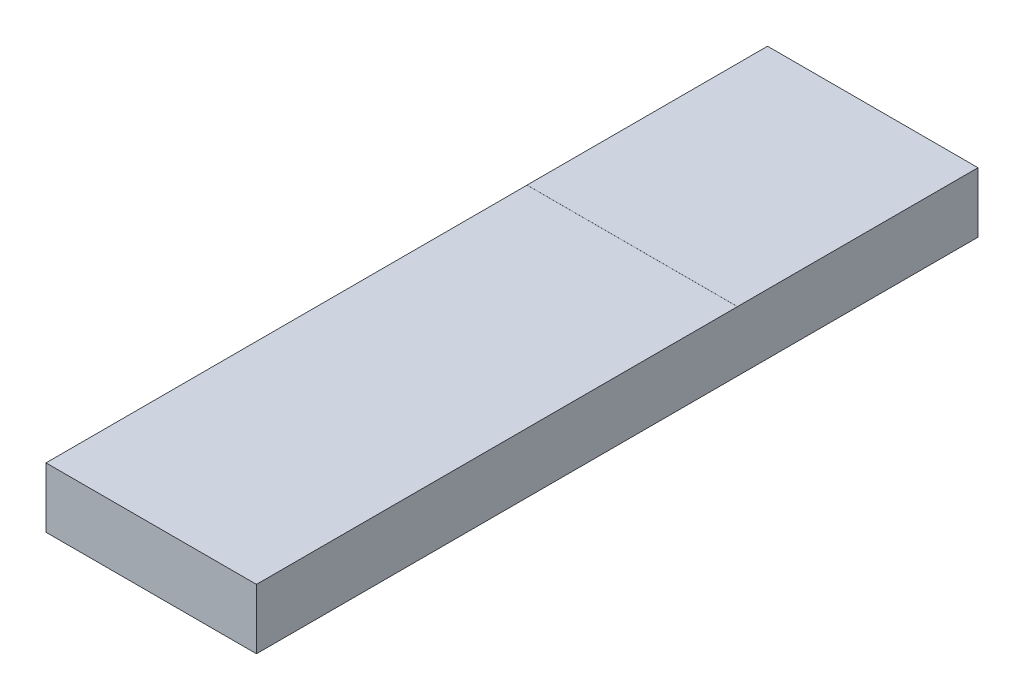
ISO-10303-21;
HEADER;
FILE_DESCRIPTION(('STEP AP214'),'2;1');
FILE_NAME('part.step','',(''),(''),'','','');
FILE_SCHEMA(('AUTOMOTIVE_DESIGN { 1 0 10303 214 1 1 1 1 }'));
ENDSEC;
DATA;
#1=APPLICATION_CONTEXT('core data for automotive mechanical design processes');
#2=APPLICATION_PROTOCOL_DEFINITION('international standard','automotive_design',2000,#1);
#3=PRODUCT_CONTEXT('',#1,'mechanical');
#4=PRODUCT('Part','Part','',(#3));
#5=PRODUCT_RELATED_PRODUCT_CATEGORY('part','',(#4));
#6=PRODUCT_DEFINITION_FORMATION('','',#4);
#7=PRODUCT_DEFINITION_CONTEXT('part definition',#1,'design');
#8=PRODUCT_DEFINITION('design','',#6,#7);
#9=PRODUCT_DEFINITION_SHAPE('','',#8);
#10=(LENGTH_UNIT() NAMED_UNIT(*) SI_UNIT(.MILLI.,.METRE.));
#11=(NAMED_UNIT(*) PLANE_ANGLE_UNIT() SI_UNIT($,.RADIAN.));
#12=(NAMED_UNIT(*) SI_UNIT($,.STERADIAN.) SOLID_ANGLE_UNIT());
#13=UNCERTAINTY_MEASURE_WITH_UNIT(LENGTH_MEASURE(1.E-05),#10,'distance_accuracy_value','');
#14=(GEOMETRIC_REPRESENTATION_CONTEXT(3) GLOBAL_UNCERTAINTY_ASSIGNED_CONTEXT((#13)) GLOBAL_UNIT_ASSIGNED_CONTEXT((#10,
#11,#12)) REPRESENTATION_CONTEXT('',''));
#15=CARTESIAN_POINT('',(0.,0.,0.));
#16=DIRECTION('',(0.,0.,1.));
#17=DIRECTION('',(1.,0.,0.));
#18=AXIS2_PLACEMENT_3D('',#15,#16,#17);
#19=CARTESIAN_POINT('',(0.,100.,1200.));
#20=DIRECTION('',(0.,-1.,0.));
#21=DIRECTION('',(0.,0.,-1.));
#22=AXIS2_PLACEMENT_3D('',#19,#20,#21);
#23=PLANE('',#22);
#24=DIRECTION('',(1.,0.,0.));
#25=VECTOR('',#24,1.);
#26=CARTESIAN_POINT('',(350.,100.,400.));
#27=LINE('',#26,#25);
#28=CARTESIAN_POINT('',(0.,100.,400.));
#29=VERTEX_POINT('',#28);
#30=CARTESIAN_POINT('',(350.,100.,400.));
#31=VERTEX_POINT('',#30);
#32=EDGE_CURVE('E56',#29,#31,#27,.T.);
#33=ORIENTED_EDGE('',*,*,#32,.F.);
#34=DIRECTION('',(0.,0.,-1.));
#35=VECTOR('',#34,1.);
#36=CARTESIAN_POINT('',(0.,100.,1200.));
#37=LINE('',#36,#35);
#38=CARTESIAN_POINT('',(0.,100.,1200.));
#39=VERTEX_POINT('',#38);
#40=EDGE_CURVE('E138',#39,#29,#37,.T.);
#41=ORIENTED_EDGE('',*,*,#40,.F.);
#42=DIRECTION('',(-1.,0.,0.));
#43=VECTOR('',#42,1.);
#44=CARTESIAN_POINT('',(0.,100.,1200.));
#45=LINE('',#44,#43);
#46=CARTESIAN_POINT('',(350.,100.,1200.));
#47=VERTEX_POINT('',#46);
#48=EDGE_CURVE('E65',#47,#39,#45,.T.);
#49=ORIENTED_EDGE('',*,*,#48,.F.);
#50=DIRECTION('',(0.,0.,-1.));
#51=VECTOR('',#50,1.);
#52=CARTESIAN_POINT('',(350.,100.,1200.));
#53=LINE('',#52,#51);
#54=EDGE_CURVE('E142',#47,#31,#53,.T.);
#55=ORIENTED_EDGE('',*,*,#54,.T.);
#56=EDGE_LOOP('',(#33,#41,#49,#55));
#57=FACE_BOUND('',#56,.T.);
#58=ADVANCED_FACE('F41',(#57),#23,.F.);
#59=CARTESIAN_POINT('',(0.,0.,1200.));
#60=DIRECTION('',(1.,0.,0.));
#61=DIRECTION('',(0.,0.,-1.));
#62=AXIS2_PLACEMENT_3D('',#59,#60,#61);
#63=PLANE('',#62);
#64=DIRECTION('',(0.,-1.,0.));
#65=VECTOR('',#64,1.);
#66=CARTESIAN_POINT('',(0.,0.,0.));
#67=LINE('',#66,#65);
#68=CARTESIAN_POINT('',(0.,100.1,0.));
#69=VERTEX_POINT('',#68);
#70=CARTESIAN_POINT('',(0.,0.,0.));
#71=VERTEX_POINT('',#70);
#72=EDGE_CURVE('E114',#69,#71,#67,.T.);
#73=ORIENTED_EDGE('',*,*,#72,.T.);
#74=DIRECTION('',(0.,0.,-1.));
#75=VECTOR('',#74,1.);
#76=CARTESIAN_POINT('',(0.,0.,1200.));
#77=LINE('',#76,#75);
#78=CARTESIAN_POINT('',(0.,0.,1200.));
#79=VERTEX_POINT('',#78);
#80=EDGE_CURVE('E11',#79,#71,#77,.T.);
#81=ORIENTED_EDGE('',*,*,#80,.F.);
#82=DIRECTION('',(0.,-1.,0.));
#83=VECTOR('',#82,1.);
#84=CARTESIAN_POINT('',(0.,0.,1200.));
#85=LINE('',#84,#83);
#86=EDGE_CURVE('E108',#39,#79,#85,.T.);
#87=ORIENTED_EDGE('',*,*,#86,.F.);
#88=ORIENTED_EDGE('',*,*,#40,.T.);
#89=DIRECTION('',(0.,-1.,0.));
#90=VECTOR('',#89,1.);
#91=CARTESIAN_POINT('',(0.,100.1,400.));
#92=LINE('',#91,#90);
#93=CARTESIAN_POINT('',(0.,100.1,400.));
#94=VERTEX_POINT('',#93);
#95=EDGE_CURVE('E130',#94,#29,#92,.T.);
#96=ORIENTED_EDGE('',*,*,#95,.F.);
#97=DIRECTION('',(0.,0.,1.));
#98=VECTOR('',#97,1.);
#99=CARTESIAN_POINT('',(0.,100.1,0.));
#100=LINE('',#99,#98);
#101=EDGE_CURVE('E117',#69,#94,#100,.T.);
#102=ORIENTED_EDGE('',*,*,#101,.F.);
#103=EDGE_LOOP('',(#73,#81,#87,#88,#96,#102));
#104=FACE_BOUND('',#103,.T.);
#105=ADVANCED_FACE('F43',(#104),#63,.F.);
#106=CARTESIAN_POINT('',(0.,0.,1200.));
#107=DIRECTION('',(0.,1.,0.));
#108=DIRECTION('',(0.,0.,1.));
#109=AXIS2_PLACEMENT_3D('',#106,#107,#108);
#110=PLANE('',#109);
#111=DIRECTION('',(1.,0.,0.));
#112=VECTOR('',#111,1.);
#113=CARTESIAN_POINT('',(0.,0.,0.));
#114=LINE('',#113,#112);
#115=CARTESIAN_POINT('',(350.,0.,0.));
#116=VERTEX_POINT('',#115);
#117=EDGE_CURVE('E78',#71,#116,#114,.T.);
#118=ORIENTED_EDGE('',*,*,#117,.T.);
#119=DIRECTION('',(0.,0.,-1.));
#120=VECTOR('',#119,1.);
#121=CARTESIAN_POINT('',(350.,0.,1200.));
#122=LINE('',#121,#120);
#123=CARTESIAN_POINT('',(350.,0.,1200.));
#124=VERTEX_POINT('',#123);
#125=EDGE_CURVE('E49',#124,#116,#122,.T.);
#126=ORIENTED_EDGE('',*,*,#125,.F.);
#127=DIRECTION('',(1.,0.,0.));
#128=VECTOR('',#127,1.);
#129=CARTESIAN_POINT('',(0.,0.,1200.));
#130=LINE('',#129,#128);
#131=EDGE_CURVE('E83',#79,#124,#130,.T.);
#132=ORIENTED_EDGE('',*,*,#131,.F.);
#133=ORIENTED_EDGE('',*,*,#80,.T.);
#134=EDGE_LOOP('',(#118,#126,#132,#133));
#135=FACE_BOUND('',#134,.T.);
#136=ADVANCED_FACE('F151',(#135),#110,.F.);
#137=CARTESIAN_POINT('',(350.,0.,1200.));
#138=DIRECTION('',(-1.,0.,0.));
#139=DIRECTION('',(0.,0.,1.));
#140=AXIS2_PLACEMENT_3D('',#137,#138,#139);
#141=PLANE('',#140);
#142=DIRECTION('',(0.,1.,0.));
#143=VECTOR('',#142,1.);
#144=CARTESIAN_POINT('',(350.,0.,0.));
#145=LINE('',#144,#143);
#146=CARTESIAN_POINT('',(350.,100.1,0.));
#147=VERTEX_POINT('',#146);
#148=EDGE_CURVE('E100',#116,#147,#145,.T.);
#149=ORIENTED_EDGE('',*,*,#148,.T.);
#150=DIRECTION('',(0.,0.,-1.));
#151=VECTOR('',#150,1.);
#152=CARTESIAN_POINT('',(350.,100.1,0.));
#153=LINE('',#152,#151);
#154=CARTESIAN_POINT('',(350.,100.1,400.));
#155=VERTEX_POINT('',#154);
#156=EDGE_CURVE('E105',#155,#147,#153,.T.);
#157=ORIENTED_EDGE('',*,*,#156,.F.);
#158=DIRECTION('',(0.,-1.,0.));
#159=VECTOR('',#158,1.);
#160=CARTESIAN_POINT('',(350.,100.1,400.));
#161=LINE('',#160,#159);
#162=EDGE_CURVE('E127',#155,#31,#161,.T.);
#163=ORIENTED_EDGE('',*,*,#162,.T.);
#164=ORIENTED_EDGE('',*,*,#54,.F.);
#165=DIRECTION('',(0.,1.,0.));
#166=VECTOR('',#165,1.);
#167=CARTESIAN_POINT('',(350.,0.,1200.));
#168=LINE('',#167,#166);
#169=EDGE_CURVE('E135',#124,#47,#168,.T.);
#170=ORIENTED_EDGE('',*,*,#169,.F.);
#171=ORIENTED_EDGE('',*,*,#125,.T.);
#172=EDGE_LOOP('',(#149,#157,#163,#164,#170,#171));
#173=FACE_BOUND('',#172,.T.);
#174=ADVANCED_FACE('F102',(#173),#141,.F.);
#175=CARTESIAN_POINT('',(0.,0.,1200.));
#176=DIRECTION('',(0.,0.,-1.));
#177=DIRECTION('',(-1.,0.,0.));
#178=AXIS2_PLACEMENT_3D('',#175,#176,#177);
#179=PLANE('',#178);
#180=ORIENTED_EDGE('',*,*,#86,.T.);
#181=ORIENTED_EDGE('',*,*,#131,.T.);
#182=ORIENTED_EDGE('',*,*,#169,.T.);
#183=ORIENTED_EDGE('',*,*,#48,.T.);
#184=EDGE_LOOP('',(#180,#181,#182,#183));
#185=FACE_BOUND('',#184,.T.);
#186=ADVANCED_FACE('F150',(#185),#179,.F.);
#187=CARTESIAN_POINT('',(0.,0.,0.));
#188=DIRECTION('',(0.,0.,-1.));
#189=DIRECTION('',(-1.,0.,0.));
#190=AXIS2_PLACEMENT_3D('',#187,#188,#189);
#191=PLANE('',#190);
#192=ORIENTED_EDGE('',*,*,#72,.F.);
#193=DIRECTION('',(-1.,0.,0.));
#194=VECTOR('',#193,1.);
#195=CARTESIAN_POINT('',(350.,100.1,0.));
#196=LINE('',#195,#194);
#197=EDGE_CURVE('E111',#147,#69,#196,.T.);
#198=ORIENTED_EDGE('',*,*,#197,.F.);
#199=ORIENTED_EDGE('',*,*,#148,.F.);
#200=ORIENTED_EDGE('',*,*,#117,.F.);
#201=EDGE_LOOP('',(#192,#198,#199,#200));
#202=FACE_BOUND('',#201,.T.);
#203=ADVANCED_FACE('F112',(#202),#191,.T.);
#204=CARTESIAN_POINT('',(350.,100.1,400.));
#205=DIRECTION('',(0.,0.,-1.));
#206=DIRECTION('',(-1.,0.,0.));
#207=AXIS2_PLACEMENT_3D('',#204,#205,#206);
#208=PLANE('',#207);
#209=ORIENTED_EDGE('',*,*,#32,.T.);
#210=ORIENTED_EDGE('',*,*,#162,.F.);
#211=DIRECTION('',(1.,0.,0.));
#212=VECTOR('',#211,1.);
#213=CARTESIAN_POINT('',(350.,100.1,400.));
#214=LINE('',#213,#212);
#215=EDGE_CURVE('E121',#94,#155,#214,.T.);
#216=ORIENTED_EDGE('',*,*,#215,.F.);
#217=ORIENTED_EDGE('',*,*,#95,.T.);
#218=EDGE_LOOP('',(#209,#210,#216,#217));
#219=FACE_BOUND('',#218,.T.);
#220=ADVANCED_FACE('F145',(#219),#208,.F.);
#221=CARTESIAN_POINT('',(0.,100.1,0.));
#222=DIRECTION('',(0.,-1.,0.));
#223=DIRECTION('',(0.,0.,-1.));
#224=AXIS2_PLACEMENT_3D('',#221,#222,#223);
#225=PLANE('',#224);
#226=ORIENTED_EDGE('',*,*,#156,.T.);
#227=ORIENTED_EDGE('',*,*,#197,.T.);
#228=ORIENTED_EDGE('',*,*,#101,.T.);
#229=ORIENTED_EDGE('',*,*,#215,.T.);
#230=EDGE_LOOP('',(#226,#227,#228,#229));
#231=FACE_BOUND('',#230,.T.);
#232=ADVANCED_FACE('F119',(#231),#225,.F.);
#233=CLOSED_SHELL('',(#58,#105,#136,#174,#186,#203,#220,#232));
#234=MANIFOLD_SOLID_BREP('B2',#233);
#235=ADVANCED_BREP_SHAPE_REPRESENTATION('',(#18,#234),#14);
#236=SHAPE_DEFINITION_REPRESENTATION(#9,#235);
ENDSEC;
END-ISO-10303-21;
